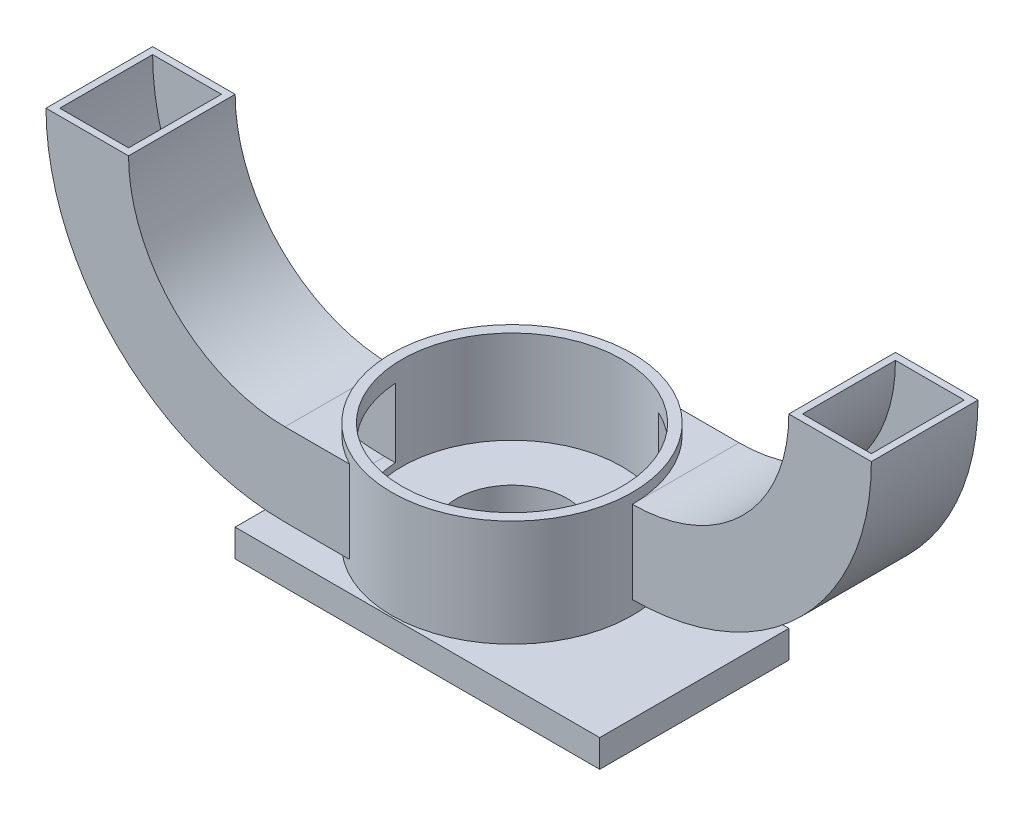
ISO-10303-21;
HEADER;
FILE_DESCRIPTION(('STEP AP214'),'2;1');
FILE_NAME('part.step','',(''),(''),'','','');
FILE_SCHEMA(('AUTOMOTIVE_DESIGN { 1 0 10303 214 1 1 1 1 }'));
ENDSEC;
DATA;
#1=APPLICATION_CONTEXT('core data for automotive mechanical design processes');
#2=APPLICATION_PROTOCOL_DEFINITION('international standard','automotive_design',2000,#1);
#3=PRODUCT_CONTEXT('',#1,'mechanical');
#4=PRODUCT('Part','Part','',(#3));
#5=PRODUCT_RELATED_PRODUCT_CATEGORY('part','',(#4));
#6=PRODUCT_DEFINITION_FORMATION('','',#4);
#7=PRODUCT_DEFINITION_CONTEXT('part definition',#1,'design');
#8=PRODUCT_DEFINITION('design','',#6,#7);
#9=PRODUCT_DEFINITION_SHAPE('','',#8);
#10=(LENGTH_UNIT() NAMED_UNIT(*) SI_UNIT(.MILLI.,.METRE.));
#11=(NAMED_UNIT(*) PLANE_ANGLE_UNIT() SI_UNIT($,.RADIAN.));
#12=(NAMED_UNIT(*) SI_UNIT($,.STERADIAN.) SOLID_ANGLE_UNIT());
#13=UNCERTAINTY_MEASURE_WITH_UNIT(LENGTH_MEASURE(1.E-05),#10,'distance_accuracy_value','');
#14=(GEOMETRIC_REPRESENTATION_CONTEXT(3) GLOBAL_UNCERTAINTY_ASSIGNED_CONTEXT((#13)) GLOBAL_UNIT_ASSIGNED_CONTEXT((#10,
#11,#12)) REPRESENTATION_CONTEXT('',''));
#15=CARTESIAN_POINT('',(0.,0.,0.));
#16=DIRECTION('',(0.,0.,1.));
#17=DIRECTION('',(1.,0.,0.));
#18=AXIS2_PLACEMENT_3D('',#15,#16,#17);
#19=CARTESIAN_POINT('',(52.2444301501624,11.,1.));
#20=DIRECTION('',(0.,-1.,0.));
#21=DIRECTION('',(0.,0.,-1.));
#22=AXIS2_PLACEMENT_3D('',#19,#20,#21);
#23=PLANE('',#22);
#24=CARTESIAN_POINT('',(0.,11.,0.));
#25=DIRECTION('',(0.,-1.,0.));
#26=DIRECTION('',(0.,0.,-1.));
#27=AXIS2_PLACEMENT_3D('',#24,#25,#26);
#28=CIRCLE('',#27,16.);
#29=CARTESIAN_POINT('',(-6.76387462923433,11.,14.5));
#30=VERTEX_POINT('',#29);
#31=CARTESIAN_POINT('',(-15.9687194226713,11.,1.));
#32=VERTEX_POINT('',#31);
#33=EDGE_CURVE('E308',#30,#32,#28,.T.);
#34=ORIENTED_EDGE('',*,*,#33,.T.);
#35=DIRECTION('',(-1.,0.,0.));
#36=VECTOR('',#35,1.);
#37=CARTESIAN_POINT('',(52.2444301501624,11.,1.));
#38=LINE('',#37,#36);
#39=CARTESIAN_POINT('',(-17.5,11.,0.999999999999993));
#40=VERTEX_POINT('',#39);
#41=EDGE_CURVE('E318',#32,#40,#38,.T.);
#42=ORIENTED_EDGE('',*,*,#41,.T.);
#43=DIRECTION('',(0.,0.,1.));
#44=VECTOR('',#43,1.);
#45=CARTESIAN_POINT('',(-17.5,11.,1.));
#46=LINE('',#45,#44);
#47=CARTESIAN_POINT('',(-17.5,11.,14.5));
#48=VERTEX_POINT('',#47);
#49=EDGE_CURVE('E350',#40,#48,#46,.T.);
#50=ORIENTED_EDGE('',*,*,#49,.T.);
#51=DIRECTION('',(-1.,0.,0.));
#52=VECTOR('',#51,1.);
#53=CARTESIAN_POINT('',(52.2444301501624,11.,14.5));
#54=LINE('',#53,#52);
#55=EDGE_CURVE('E320',#30,#48,#54,.T.);
#56=ORIENTED_EDGE('',*,*,#55,.F.);
#57=EDGE_LOOP('',(#34,#42,#50,#56));
#58=FACE_BOUND('',#57,.T.);
#59=ADVANCED_FACE('F119',(#58),#23,.F.);
#60=CARTESIAN_POINT('',(52.2444301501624,11.,14.5));
#61=DIRECTION('',(0.,0.,1.));
#62=DIRECTION('',(1.,0.,0.));
#63=AXIS2_PLACEMENT_3D('',#60,#61,#62);
#64=PLANE('',#63);
#65=DIRECTION('',(0.,-1.,0.));
#66=VECTOR('',#65,1.);
#67=CARTESIAN_POINT('',(-6.76387462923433,44.7443438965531,14.5));
#68=LINE('',#67,#66);
#69=CARTESIAN_POINT('',(-6.76387462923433,21.,14.5));
#70=VERTEX_POINT('',#69);
#71=EDGE_CURVE('E323',#70,#30,#68,.T.);
#72=ORIENTED_EDGE('',*,*,#71,.T.);
#73=ORIENTED_EDGE('',*,*,#55,.T.);
#74=CARTESIAN_POINT('',(-17.5,44.7424301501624,14.5));
#75=DIRECTION('',(0.,0.,-1.));
#76=DIRECTION('',(0.,-1.,0.));
#77=AXIS2_PLACEMENT_3D('',#74,#75,#76);
#78=CIRCLE('',#77,33.7424301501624);
#79=CARTESIAN_POINT('',(-51.2424301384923,44.7433175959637,14.5));
#80=VERTEX_POINT('',#79);
#81=EDGE_CURVE('E967',#48,#80,#78,.T.);
#82=ORIENTED_EDGE('',*,*,#81,.T.);
#83=DIRECTION('',(0.99999999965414,-2.63005894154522E-05,0.));
#84=VECTOR('',#83,1.);
#85=CARTESIAN_POINT('',(-51.2424301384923,44.7433175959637,14.5));
#86=LINE('',#85,#84);
#87=CARTESIAN_POINT('',(-41.2424301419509,44.7430545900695,14.5));
#88=VERTEX_POINT('',#87);
#89=EDGE_CURVE('E961',#88,#80,#86,.F.);
#90=ORIENTED_EDGE('',*,*,#89,.F.);
#91=CARTESIAN_POINT('',(-17.5,44.7424301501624,14.5));
#92=DIRECTION('',(0.,0.,-1.));
#93=DIRECTION('',(0.,-1.,0.));
#94=AXIS2_PLACEMENT_3D('',#91,#92,#93);
#95=CIRCLE('',#94,23.7424301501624);
#96=CARTESIAN_POINT('',(-17.5,21.,14.5));
#97=VERTEX_POINT('',#96);
#98=EDGE_CURVE('E956',#97,#88,#95,.T.);
#99=ORIENTED_EDGE('',*,*,#98,.F.);
#100=DIRECTION('',(-1.,0.,0.));
#101=VECTOR('',#100,1.);
#102=CARTESIAN_POINT('',(52.2444301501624,21.,14.5));
#103=LINE('',#102,#101);
#104=EDGE_CURVE('E335',#70,#97,#103,.T.);
#105=ORIENTED_EDGE('',*,*,#104,.F.);
#106=EDGE_LOOP('',(#72,#73,#82,#90,#99,#105));
#107=FACE_BOUND('',#106,.T.);
#108=ADVANCED_FACE('F803',(#107),#64,.F.);
#109=CARTESIAN_POINT('',(52.2444301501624,21.,1.));
#110=DIRECTION('',(0.,1.,0.));
#111=DIRECTION('',(0.,0.,1.));
#112=AXIS2_PLACEMENT_3D('',#109,#110,#111);
#113=PLANE('',#112);
#114=CARTESIAN_POINT('',(0.,21.,0.));
#115=DIRECTION('',(0.,1.,0.));
#116=DIRECTION('',(0.,0.,1.));
#117=AXIS2_PLACEMENT_3D('',#114,#115,#116);
#118=CIRCLE('',#117,16.);
#119=CARTESIAN_POINT('',(-15.9687194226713,21.,1.));
#120=VERTEX_POINT('',#119);
#121=EDGE_CURVE('E138',#120,#70,#118,.T.);
#122=ORIENTED_EDGE('',*,*,#121,.T.);
#123=ORIENTED_EDGE('',*,*,#104,.T.);
#124=DIRECTION('',(0.,0.,-1.));
#125=VECTOR('',#124,1.);
#126=CARTESIAN_POINT('',(-17.5,21.,1.));
#127=LINE('',#126,#125);
#128=CARTESIAN_POINT('',(-17.5,21.,0.999999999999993));
#129=VERTEX_POINT('',#128);
#130=EDGE_CURVE('E921',#97,#129,#127,.T.);
#131=ORIENTED_EDGE('',*,*,#130,.T.);
#132=DIRECTION('',(-1.,0.,0.));
#133=VECTOR('',#132,1.);
#134=CARTESIAN_POINT('',(52.2444301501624,21.,1.));
#135=LINE('',#134,#133);
#136=EDGE_CURVE('E343',#120,#129,#135,.T.);
#137=ORIENTED_EDGE('',*,*,#136,.F.);
#138=EDGE_LOOP('',(#122,#123,#131,#137));
#139=FACE_BOUND('',#138,.T.);
#140=ADVANCED_FACE('F808',(#139),#113,.F.);
#141=CARTESIAN_POINT('',(52.2444301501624,11.,1.));
#142=DIRECTION('',(0.,0.,-1.));
#143=DIRECTION('',(-1.,0.,0.));
#144=AXIS2_PLACEMENT_3D('',#141,#142,#143);
#145=PLANE('',#144);
#146=DIRECTION('',(0.,-1.,0.));
#147=VECTOR('',#146,1.);
#148=CARTESIAN_POINT('',(-15.9687194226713,44.7443438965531,1.));
#149=LINE('',#148,#147);
#150=EDGE_CURVE('E305',#32,#120,#149,.F.);
#151=ORIENTED_EDGE('',*,*,#150,.T.);
#152=ORIENTED_EDGE('',*,*,#136,.T.);
#153=CARTESIAN_POINT('',(-17.5,44.7424301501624,0.999999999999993));
#154=DIRECTION('',(0.,0.,-1.));
#155=DIRECTION('',(0.,-1.,0.));
#156=AXIS2_PLACEMENT_3D('',#153,#154,#155);
#157=CIRCLE('',#156,23.7424301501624);
#158=CARTESIAN_POINT('',(-41.2424301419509,44.7430545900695,0.999999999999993));
#159=VERTEX_POINT('',#158);
#160=EDGE_CURVE('E958',#129,#159,#157,.T.);
#161=ORIENTED_EDGE('',*,*,#160,.T.);
#162=DIRECTION('',(-0.99999999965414,2.63005894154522E-05,0.));
#163=VECTOR('',#162,1.);
#164=CARTESIAN_POINT('',(-51.2424301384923,44.7433175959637,0.999999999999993));
#165=LINE('',#164,#163);
#166=CARTESIAN_POINT('',(-51.2424301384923,44.7433175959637,0.999999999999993));
#167=VERTEX_POINT('',#166);
#168=EDGE_CURVE('E980',#167,#159,#165,.F.);
#169=ORIENTED_EDGE('',*,*,#168,.F.);
#170=CARTESIAN_POINT('',(-17.5,44.7424301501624,0.999999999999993));
#171=DIRECTION('',(0.,0.,-1.));
#172=DIRECTION('',(0.,-1.,0.));
#173=AXIS2_PLACEMENT_3D('',#170,#171,#172);
#174=CIRCLE('',#173,33.7424301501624);
#175=EDGE_CURVE('E329',#40,#167,#174,.T.);
#176=ORIENTED_EDGE('',*,*,#175,.F.);
#177=ORIENTED_EDGE('',*,*,#41,.F.);
#178=EDGE_LOOP('',(#151,#152,#161,#169,#176,#177));
#179=FACE_BOUND('',#178,.T.);
#180=ADVANCED_FACE('F326',(#179),#145,.F.);
#181=CARTESIAN_POINT('',(26.5,4.,-13.75));
#182=DIRECTION('',(-1.,0.,0.));
#183=DIRECTION('',(0.,0.,1.));
#184=AXIS2_PLACEMENT_3D('',#181,#182,#183);
#185=PLANE('',#184);
#186=CARTESIAN_POINT('',(26.5,0.,-13.75));
#187=CARTESIAN_POINT('',(26.5,0.,-11.4583333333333));
#188=CARTESIAN_POINT('',(26.5,0.,-9.16666666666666));
#189=CARTESIAN_POINT('',(26.5,0.,-4.58333333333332));
#190=CARTESIAN_POINT('',(26.5,0.,-2.29166666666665));
#191=CARTESIAN_POINT('',(26.5,0.,2.29166666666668));
#192=CARTESIAN_POINT('',(26.5,0.,4.58333333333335));
#193=CARTESIAN_POINT('',(26.5,0.,9.16666666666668));
#194=CARTESIAN_POINT('',(26.5,0.,11.4583333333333));
#195=CARTESIAN_POINT('',(26.5,0.,13.75));
#196=B_SPLINE_CURVE_WITH_KNOTS('',3,(#186,#187,#188,#189,#190,#191,#192,#193,#194,#195),
.UNSPECIFIED.,.F.,.F.,(4,2,2,2,4),(0.,0.25,0.5,0.75,1.),.UNSPECIFIED.);
#197=CARTESIAN_POINT('',(26.5,0.,13.75));
#198=VERTEX_POINT('',#197);
#199=CARTESIAN_POINT('',(26.5,0.,-13.75));
#200=VERTEX_POINT('',#199);
#201=EDGE_CURVE('E608',#198,#200,#196,.F.);
#202=ORIENTED_EDGE('',*,*,#201,.T.);
#203=DIRECTION('',(0.,-1.,0.));
#204=VECTOR('',#203,1.);
#205=CARTESIAN_POINT('',(26.5,4.,-13.75));
#206=LINE('',#205,#204);
#207=CARTESIAN_POINT('',(26.5,4.,-13.75));
#208=VERTEX_POINT('',#207);
#209=EDGE_CURVE('E131',#208,#200,#206,.T.);
#210=ORIENTED_EDGE('',*,*,#209,.F.);
#211=DIRECTION('',(0.,0.,-1.));
#212=VECTOR('',#211,1.);
#213=CARTESIAN_POINT('',(26.5,4.,-13.75));
#214=LINE('',#213,#212);
#215=CARTESIAN_POINT('',(26.5,4.,13.75));
#216=VERTEX_POINT('',#215);
#217=EDGE_CURVE('E741',#216,#208,#214,.T.);
#218=ORIENTED_EDGE('',*,*,#217,.F.);
#219=DIRECTION('',(0.,-1.,0.));
#220=VECTOR('',#219,1.);
#221=CARTESIAN_POINT('',(26.5,4.,13.75));
#222=LINE('',#221,#220);
#223=EDGE_CURVE('E671',#216,#198,#222,.T.);
#224=ORIENTED_EDGE('',*,*,#223,.T.);
#225=EDGE_LOOP('',(#202,#210,#218,#224));
#226=FACE_BOUND('',#225,.T.);
#227=ADVANCED_FACE('F121',(#226),#185,.F.);
#228=CARTESIAN_POINT('',(-26.5,4.,-13.75));
#229=DIRECTION('',(0.,0.,1.));
#230=DIRECTION('',(1.,0.,0.));
#231=AXIS2_PLACEMENT_3D('',#228,#229,#230);
#232=PLANE('',#231);
#233=CARTESIAN_POINT('',(-26.5,0.,-13.75));
#234=CARTESIAN_POINT('',(-24.2916666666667,0.,-13.75));
#235=CARTESIAN_POINT('',(-22.0833333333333,0.,-13.75));
#236=CARTESIAN_POINT('',(-17.6666666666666,0.,-13.75));
#237=CARTESIAN_POINT('',(-15.4583333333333,0.,-13.75));
#238=CARTESIAN_POINT('',(-11.0416666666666,0.,-13.75));
#239=CARTESIAN_POINT('',(-8.8333333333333,0.,-13.75));
#240=CARTESIAN_POINT('',(-4.41666666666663,0.,-13.75));
#241=CARTESIAN_POINT('',(-2.2083333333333,0.,-13.75));
#242=CARTESIAN_POINT('',(2.20833333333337,0.,-13.75));
#243=CARTESIAN_POINT('',(4.4166666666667,0.,-13.75));
#244=CARTESIAN_POINT('',(8.83333333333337,0.,-13.75));
#245=CARTESIAN_POINT('',(11.0416666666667,0.,-13.75));
#246=CARTESIAN_POINT('',(15.4583333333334,0.,-13.75));
#247=CARTESIAN_POINT('',(17.6666666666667,0.,-13.75));
#248=CARTESIAN_POINT('',(22.0833333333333,0.,-13.75));
#249=CARTESIAN_POINT('',(24.2916666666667,0.,-13.75));
#250=CARTESIAN_POINT('',(26.5,0.,-13.75));
#251=B_SPLINE_CURVE_WITH_KNOTS('',3,(#233,#234,#235,#236,#237,#238,#239,#240,#241,#242,#243,
#244,#245,#246,#247,#248,#249,#250),.UNSPECIFIED.,.F.,.F.,(4,2,2,2,2,2,2,2,4),(0.,0.125,0.25,
0.375,0.5,0.625,0.75,0.875,1.),.UNSPECIFIED.);
#252=CARTESIAN_POINT('',(-26.5,0.,-13.75));
#253=VERTEX_POINT('',#252);
#254=EDGE_CURVE('E518',#200,#253,#251,.F.);
#255=ORIENTED_EDGE('',*,*,#254,.T.);
#256=DIRECTION('',(0.,-1.,0.));
#257=VECTOR('',#256,1.);
#258=CARTESIAN_POINT('',(-26.5,4.,-13.75));
#259=LINE('',#258,#257);
#260=CARTESIAN_POINT('',(-26.5,4.,-13.75));
#261=VERTEX_POINT('',#260);
#262=EDGE_CURVE('E666',#261,#253,#259,.T.);
#263=ORIENTED_EDGE('',*,*,#262,.F.);
#264=DIRECTION('',(-1.,0.,0.));
#265=VECTOR('',#264,1.);
#266=CARTESIAN_POINT('',(-26.5,4.,-13.75));
#267=LINE('',#266,#265);
#268=EDGE_CURVE('E661',#208,#261,#267,.T.);
#269=ORIENTED_EDGE('',*,*,#268,.F.);
#270=ORIENTED_EDGE('',*,*,#209,.T.);
#271=EDGE_LOOP('',(#255,#263,#269,#270));
#272=FACE_BOUND('',#271,.T.);
#273=ADVANCED_FACE('F657',(#272),#232,.F.);
#274=CARTESIAN_POINT('',(-26.5,4.,-13.75));
#275=DIRECTION('',(1.,0.,0.));
#276=DIRECTION('',(0.,0.,-1.));
#277=AXIS2_PLACEMENT_3D('',#274,#275,#276);
#278=PLANE('',#277);
#279=CARTESIAN_POINT('',(-26.5,0.,13.75));
#280=CARTESIAN_POINT('',(-26.5,0.,11.4583333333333));
#281=CARTESIAN_POINT('',(-26.5,0.,9.16666666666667));
#282=CARTESIAN_POINT('',(-26.5,0.,4.58333333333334));
#283=CARTESIAN_POINT('',(-26.5,0.,2.29166666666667));
#284=CARTESIAN_POINT('',(-26.5,0.,-2.29166666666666));
#285=CARTESIAN_POINT('',(-26.5,0.,-4.58333333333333));
#286=CARTESIAN_POINT('',(-26.5,0.,-9.16666666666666));
#287=CARTESIAN_POINT('',(-26.5,0.,-11.4583333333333));
#288=CARTESIAN_POINT('',(-26.5,0.,-13.75));
#289=B_SPLINE_CURVE_WITH_KNOTS('',3,(#279,#280,#281,#282,#283,#284,#285,#286,#287,#288),
.UNSPECIFIED.,.F.,.F.,(4,2,2,2,4),(0.,0.25,0.5,0.75,1.),.UNSPECIFIED.);
#290=CARTESIAN_POINT('',(-26.5,0.,13.75));
#291=VERTEX_POINT('',#290);
#292=EDGE_CURVE('E643',#253,#291,#289,.F.);
#293=ORIENTED_EDGE('',*,*,#292,.T.);
#294=DIRECTION('',(0.,-1.,0.));
#295=VECTOR('',#294,1.);
#296=CARTESIAN_POINT('',(-26.5,4.,13.75));
#297=LINE('',#296,#295);
#298=CARTESIAN_POINT('',(-26.5,4.,13.75));
#299=VERTEX_POINT('',#298);
#300=EDGE_CURVE('E687',#299,#291,#297,.T.);
#301=ORIENTED_EDGE('',*,*,#300,.F.);
#302=DIRECTION('',(0.,0.,1.));
#303=VECTOR('',#302,1.);
#304=CARTESIAN_POINT('',(-26.5,4.,-13.75));
#305=LINE('',#304,#303);
#306=EDGE_CURVE('E746',#261,#299,#305,.T.);
#307=ORIENTED_EDGE('',*,*,#306,.F.);
#308=ORIENTED_EDGE('',*,*,#262,.T.);
#309=EDGE_LOOP('',(#293,#301,#307,#308));
#310=FACE_BOUND('',#309,.T.);
#311=ADVANCED_FACE('F710',(#310),#278,.F.);
#312=CARTESIAN_POINT('',(-26.5,4.,13.75));
#313=DIRECTION('',(0.,0.,-1.));
#314=DIRECTION('',(-1.,0.,0.));
#315=AXIS2_PLACEMENT_3D('',#312,#313,#314);
#316=PLANE('',#315);
#317=CARTESIAN_POINT('',(26.5,0.,13.75));
#318=CARTESIAN_POINT('',(24.2916666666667,0.,13.75));
#319=CARTESIAN_POINT('',(22.0833333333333,0.,13.75));
#320=CARTESIAN_POINT('',(17.6666666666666,0.,13.75));
#321=CARTESIAN_POINT('',(15.4583333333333,0.,13.75));
#322=CARTESIAN_POINT('',(11.0416666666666,0.,13.75));
#323=CARTESIAN_POINT('',(8.83333333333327,0.,13.75));
#324=CARTESIAN_POINT('',(4.4166666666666,0.,13.75));
#325=CARTESIAN_POINT('',(2.20833333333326,0.,13.75));
#326=CARTESIAN_POINT('',(-2.2083333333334,0.,13.75));
#327=CARTESIAN_POINT('',(-4.41666666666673,0.,13.75));
#328=CARTESIAN_POINT('',(-8.83333333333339,0.,13.75));
#329=CARTESIAN_POINT('',(-11.0416666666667,0.,13.75));
#330=CARTESIAN_POINT('',(-15.4583333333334,0.,13.75));
#331=CARTESIAN_POINT('',(-17.6666666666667,0.,13.75));
#332=CARTESIAN_POINT('',(-22.0833333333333,0.,13.75));
#333=CARTESIAN_POINT('',(-24.2916666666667,0.,13.75));
#334=CARTESIAN_POINT('',(-26.5,0.,13.75));
#335=B_SPLINE_CURVE_WITH_KNOTS('',3,(#317,#318,#319,#320,#321,#322,#323,#324,#325,#326,#327,
#328,#329,#330,#331,#332,#333,#334),.UNSPECIFIED.,.F.,.F.,(4,2,2,2,2,2,2,2,4),(0.,0.125,0.25,
0.375,0.5,0.625,0.75,0.875,1.),.UNSPECIFIED.);
#336=EDGE_CURVE('E626',#291,#198,#335,.F.);
#337=ORIENTED_EDGE('',*,*,#336,.T.);
#338=ORIENTED_EDGE('',*,*,#223,.F.);
#339=DIRECTION('',(1.,0.,0.));
#340=VECTOR('',#339,1.);
#341=CARTESIAN_POINT('',(-26.5,4.,13.75));
#342=LINE('',#341,#340);
#343=EDGE_CURVE('E688',#299,#216,#342,.T.);
#344=ORIENTED_EDGE('',*,*,#343,.F.);
#345=ORIENTED_EDGE('',*,*,#300,.T.);
#346=EDGE_LOOP('',(#337,#338,#344,#345));
#347=FACE_BOUND('',#346,.T.);
#348=ADVANCED_FACE('F699',(#347),#316,.F.);
#349=CARTESIAN_POINT('',(0.,4.,0.));
#350=DIRECTION('',(0.,1.,0.));
#351=DIRECTION('',(0.,0.,1.));
#352=AXIS2_PLACEMENT_3D('',#349,#350,#351);
#353=PLANE('',#352);
#354=CARTESIAN_POINT('',(0.,4.,0.));
#355=DIRECTION('',(0.,1.,0.));
#356=DIRECTION('',(0.,0.,1.));
#357=AXIS2_PLACEMENT_3D('',#354,#355,#356);
#358=CIRCLE('',#357,9.5);
#359=CARTESIAN_POINT('',(0.,4.,9.5));
#360=VERTEX_POINT('',#359);
#361=EDGE_CURVE('E737',#360,#360,#358,.T.);
#362=ORIENTED_EDGE('',*,*,#361,.F.);
#363=EDGE_LOOP('',(#362));
#364=FACE_BOUND('',#363,.T.);
#365=ORIENTED_EDGE('',*,*,#217,.T.);
#366=ORIENTED_EDGE('',*,*,#268,.T.);
#367=ORIENTED_EDGE('',*,*,#306,.T.);
#368=ORIENTED_EDGE('',*,*,#343,.T.);
#369=EDGE_LOOP('',(#365,#366,#367,#368));
#370=FACE_BOUND('',#369,.T.);
#371=ADVANCED_FACE('F709',(#364,#370),#353,.T.);
#372=CARTESIAN_POINT('',(0.,8.,0.));
#373=DIRECTION('',(0.,-1.,0.));
#374=DIRECTION('',(0.,0.,-1.));
#375=AXIS2_PLACEMENT_3D('',#372,#373,#374);
#376=CYLINDRICAL_SURFACE('',#375,9.5);
#377=CARTESIAN_POINT('',(0.,8.,0.));
#378=DIRECTION('',(0.,1.,0.));
#379=DIRECTION('',(0.,0.,1.));
#380=AXIS2_PLACEMENT_3D('',#377,#378,#379);
#381=CIRCLE('',#380,9.5);
#382=CARTESIAN_POINT('',(0.,8.,9.5));
#383=VERTEX_POINT('',#382);
#384=EDGE_CURVE('E673',#383,#383,#381,.T.);
#385=ORIENTED_EDGE('',*,*,#384,.F.);
#386=EDGE_LOOP('',(#385));
#387=FACE_BOUND('',#386,.T.);
#388=ORIENTED_EDGE('',*,*,#361,.T.);
#389=EDGE_LOOP('',(#388));
#390=FACE_BOUND('',#389,.T.);
#391=ADVANCED_FACE('F788',(#387,#390),#376,.T.);
#392=CARTESIAN_POINT('',(0.,8.,0.));
#393=DIRECTION('',(0.,-1.,0.));
#394=DIRECTION('',(0.,0.,-1.));
#395=AXIS2_PLACEMENT_3D('',#392,#393,#394);
#396=CYLINDRICAL_SURFACE('',#395,8.);
#397=CARTESIAN_POINT('',(-7.10102206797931,4.,-3.6844925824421));
#398=CARTESIAN_POINT('',(-7.38384468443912,4.,-3.13941626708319));
#399=CARTESIAN_POINT('',(-7.61124088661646,4.,-2.54558802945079));
#400=CARTESIAN_POINT('',(-7.91949557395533,4.,-1.30099811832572));
#401=CARTESIAN_POINT('',(-8.,4.,-0.650638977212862));
#402=CARTESIAN_POINT('',(-8.,4.,0.650638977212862));
#403=CARTESIAN_POINT('',(-7.91949557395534,4.,1.30099811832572));
#404=CARTESIAN_POINT('',(-7.61124088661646,4.,2.54558802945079));
#405=CARTESIAN_POINT('',(-7.38384468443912,4.,3.13941626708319));
#406=CARTESIAN_POINT('',(-7.10102206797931,4.,3.6844925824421));
#407=B_SPLINE_CURVE_WITH_KNOTS('',3,(#397,#398,#399,#400,#401,#402,#403,#404,#405,#406),
.UNSPECIFIED.,.F.,.F.,(4,2,2,2,4),(0.,0.25,0.5,0.75,1.),.UNSPECIFIED.);
#408=CARTESIAN_POINT('',(-7.10134528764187,4.,3.68465908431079));
#409=VERTEX_POINT('',#408);
#410=CARTESIAN_POINT('',(-7.10131944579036,4.,-3.68464576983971));
#411=VERTEX_POINT('',#410);
#412=EDGE_CURVE('E12',#409,#411,#407,.F.);
#413=ORIENTED_EDGE('',*,*,#412,.T.);
#414=CARTESIAN_POINT('',(0.,4.,0.));
#415=DIRECTION('',(0.,-1.,0.));
#416=DIRECTION('',(0.,0.,1.));
#417=AXIS2_PLACEMENT_3D('',#414,#415,#416);
#418=CIRCLE('',#417,8.);
#419=CARTESIAN_POINT('',(7.10134528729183,4.,-3.68465908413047));
#420=VERTEX_POINT('',#419);
#421=EDGE_CURVE('E653',#411,#420,#418,.T.);
#422=ORIENTED_EDGE('',*,*,#421,.T.);
#423=CARTESIAN_POINT('',(7.10131944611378,4.,3.68464577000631));
#424=VERTEX_POINT('',#423);
#425=EDGE_CURVE('E569',#420,#424,#418,.T.);
#426=ORIENTED_EDGE('',*,*,#425,.T.);
#427=EDGE_CURVE('E124',#424,#409,#418,.T.);
#428=ORIENTED_EDGE('',*,*,#427,.T.);
#429=EDGE_LOOP('',(#413,#422,#426,#428));
#430=FACE_BOUND('',#429,.T.);
#431=CARTESIAN_POINT('',(0.,10.,0.));
#432=DIRECTION('',(0.,1.,0.));
#433=DIRECTION('',(0.,0.,1.));
#434=AXIS2_PLACEMENT_3D('',#431,#432,#433);
#435=CIRCLE('',#434,8.);
#436=CARTESIAN_POINT('',(0.,10.,8.));
#437=VERTEX_POINT('',#436);
#438=EDGE_CURVE('E509',#437,#437,#435,.T.);
#439=ORIENTED_EDGE('',*,*,#438,.T.);
#440=EDGE_LOOP('',(#439));
#441=FACE_BOUND('',#440,.T.);
#442=ADVANCED_FACE('F544',(#430,#441),#396,.F.);
#443=CARTESIAN_POINT('',(-26.5,0.,13.75));
#444=CARTESIAN_POINT('',(-7.10102206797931,4.,3.6844925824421));
#445=CARTESIAN_POINT('',(-24.2916666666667,0.,13.75));
#446=CARTESIAN_POINT('',(-6.82848391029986,4.,4.20974794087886));
#447=CARTESIAN_POINT('',(-22.0833333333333,0.,13.75));
#448=CARTESIAN_POINT('',(-6.47840329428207,4.,4.74135288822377));
#449=CARTESIAN_POINT('',(-17.6666666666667,0.,13.75));
#450=CARTESIAN_POINT('',(-5.59819436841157,4.,5.75415990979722));
#451=CARTESIAN_POINT('',(-15.4583333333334,0.,13.75));
#452=CARTESIAN_POINT('',(-5.06727923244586,4.,6.23481894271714));
#453=CARTESIAN_POINT('',(-11.0416666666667,0.,13.75));
#454=CARTESIAN_POINT('',(-3.83447305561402,4.,7.06024804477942));
#455=CARTESIAN_POINT('',(-8.83333333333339,0.,13.75));
#456=CARTESIAN_POINT('',(-3.13235785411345,4.,7.40375831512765));
#457=CARTESIAN_POINT('',(-4.41666666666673,0.,13.75));
#458=CARTESIAN_POINT('',(-1.61978954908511,4.,7.87423550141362));
#459=CARTESIAN_POINT('',(-2.2083333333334,0.,13.75));
#460=CARTESIAN_POINT('',(-0.810307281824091,4.,8.));
#461=CARTESIAN_POINT('',(2.20833333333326,0.,13.75));
#462=CARTESIAN_POINT('',(0.810307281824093,4.,8.));
#463=CARTESIAN_POINT('',(4.4166666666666,0.,13.75));
#464=CARTESIAN_POINT('',(1.61978954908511,4.,7.87423550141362));
#465=CARTESIAN_POINT('',(8.83333333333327,0.,13.75));
#466=CARTESIAN_POINT('',(3.13235785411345,4.,7.40375831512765));
#467=CARTESIAN_POINT('',(11.0416666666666,0.,13.75));
#468=CARTESIAN_POINT('',(3.83447305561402,4.,7.06024804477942));
#469=CARTESIAN_POINT('',(15.4583333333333,0.,13.75));
#470=CARTESIAN_POINT('',(5.06727923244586,4.,6.23481894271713));
#471=CARTESIAN_POINT('',(17.6666666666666,0.,13.75));
#472=CARTESIAN_POINT('',(5.59819436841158,4.,5.75415990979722));
#473=CARTESIAN_POINT('',(22.0833333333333,0.,13.75));
#474=CARTESIAN_POINT('',(6.47840329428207,4.,4.74135288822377));
#475=CARTESIAN_POINT('',(24.2916666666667,0.,13.75));
#476=CARTESIAN_POINT('',(6.82848391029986,4.,4.20974794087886));
#477=CARTESIAN_POINT('',(26.5,0.,13.75));
#478=CARTESIAN_POINT('',(7.10102206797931,4.,3.68449258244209));
#479=B_SPLINE_SURFACE_WITH_KNOTS('',3,1,((#443,#444),(#445,#446),(#447,#448),(#449,#450),(#451,
#452),(#453,#454),(#455,#456),(#457,#458),(#459,#460),(#461,#462),(#463,#464),(#465,#466),(#467,
#468),(#469,#470),(#471,#472),(#473,#474),(#475,#476),(#477,#478)),.UNSPECIFIED.,.F.,.F.,.F.,(4,
2,2,2,2,2,2,2,4),(2,2),(0.,0.125,0.25,0.375,0.5,0.625,0.75,0.875,1.),(0.,1.),.UNSPECIFIED.);
#480=DIRECTION('',(-0.87312409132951,-0.180035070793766,0.453036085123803));
#481=VECTOR('',#480,1.);
#482=CARTESIAN_POINT('',(-16.8005110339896,2.,8.71724629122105));
#483=LINE('',#482,#481);
#484=EDGE_CURVE('E513',#409,#291,#483,.T.);
#485=DIRECTION('',(-0.87312409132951,0.180035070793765,-0.453036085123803));
#486=VECTOR('',#485,1.);
#487=CARTESIAN_POINT('',(16.8005110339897,2.,8.71724629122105));
#488=LINE('',#487,#486);
#489=EDGE_CURVE('E612',#198,#424,#488,.T.);
#490=ORIENTED_EDGE('',*,*,#336,.F.);
#491=ORIENTED_EDGE('',*,*,#484,.F.);
#492=ORIENTED_EDGE('',*,*,#427,.F.);
#493=ORIENTED_EDGE('',*,*,#489,.F.);
#494=EDGE_LOOP('',(#490,#491,#492,#493));
#495=FACE_BOUND('',#494,.T.);
#496=ADVANCED_FACE('F586',(#495),#479,.F.);
#497=CARTESIAN_POINT('',(26.5,0.,13.75));
#498=CARTESIAN_POINT('',(7.10102206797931,4.,3.68449258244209));
#499=CARTESIAN_POINT('',(26.5,0.,11.4583333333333));
#500=CARTESIAN_POINT('',(7.38384468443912,4.,3.13941626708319));
#501=CARTESIAN_POINT('',(26.5,0.,9.16666666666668));
#502=CARTESIAN_POINT('',(7.61124088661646,4.,2.54558802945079));
#503=CARTESIAN_POINT('',(26.5,0.,4.58333333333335));
#504=CARTESIAN_POINT('',(7.91949557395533,4.,1.30099811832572));
#505=CARTESIAN_POINT('',(26.5,0.,2.29166666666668));
#506=CARTESIAN_POINT('',(8.,4.,0.650638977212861));
#507=CARTESIAN_POINT('',(26.5,0.,-2.29166666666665));
#508=CARTESIAN_POINT('',(8.,4.,-0.650638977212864));
#509=CARTESIAN_POINT('',(26.5,0.,-4.58333333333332));
#510=CARTESIAN_POINT('',(7.91949557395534,4.,-1.30099811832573));
#511=CARTESIAN_POINT('',(26.5,0.,-9.16666666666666));
#512=CARTESIAN_POINT('',(7.61124088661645,4.,-2.54558802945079));
#513=CARTESIAN_POINT('',(26.5,0.,-11.4583333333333));
#514=CARTESIAN_POINT('',(7.38384468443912,4.,-3.13941626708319));
#515=CARTESIAN_POINT('',(26.5,0.,-13.75));
#516=CARTESIAN_POINT('',(7.10102206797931,4.,-3.6844925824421));
#517=B_SPLINE_SURFACE_WITH_KNOTS('',3,1,((#497,#498),(#499,#500),(#501,#502),(#503,#504),(#505,
#506),(#507,#508),(#509,#510),(#511,#512),(#513,#514),(#515,#516)),.UNSPECIFIED.,.F.,.F.,.F.,(4,
2,2,2,4),(2,2),(0.,0.25,0.5,0.75,1.),(0.,1.),.UNSPECIFIED.);
#518=DIRECTION('',(-0.87312409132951,0.180035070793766,0.453036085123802));
#519=VECTOR('',#518,1.);
#520=CARTESIAN_POINT('',(16.8005110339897,2.,-8.71724629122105));
#521=LINE('',#520,#519);
#522=EDGE_CURVE('E524',#200,#420,#521,.T.);
#523=ORIENTED_EDGE('',*,*,#201,.F.);
#524=ORIENTED_EDGE('',*,*,#489,.T.);
#525=ORIENTED_EDGE('',*,*,#425,.F.);
#526=ORIENTED_EDGE('',*,*,#522,.F.);
#527=EDGE_LOOP('',(#523,#524,#525,#526));
#528=FACE_BOUND('',#527,.T.);
#529=ADVANCED_FACE('F575',(#528),#517,.F.);
#530=CARTESIAN_POINT('',(-26.5,0.,-13.75));
#531=CARTESIAN_POINT('',(-7.10102206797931,4.,-3.6844925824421));
#532=CARTESIAN_POINT('',(-26.5,0.,-11.4583333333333));
#533=CARTESIAN_POINT('',(-7.38384468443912,4.,-3.13941626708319));
#534=CARTESIAN_POINT('',(-26.5,0.,-9.16666666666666));
#535=CARTESIAN_POINT('',(-7.61124088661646,4.,-2.54558802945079));
#536=CARTESIAN_POINT('',(-26.5,0.,-4.58333333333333));
#537=CARTESIAN_POINT('',(-7.91949557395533,4.,-1.30099811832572));
#538=CARTESIAN_POINT('',(-26.5,0.,-2.29166666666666));
#539=CARTESIAN_POINT('',(-8.,4.,-0.650638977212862));
#540=CARTESIAN_POINT('',(-26.5,0.,2.29166666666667));
#541=CARTESIAN_POINT('',(-8.,4.,0.650638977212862));
#542=CARTESIAN_POINT('',(-26.5,0.,4.58333333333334));
#543=CARTESIAN_POINT('',(-7.91949557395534,4.,1.30099811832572));
#544=CARTESIAN_POINT('',(-26.5,0.,9.16666666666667));
#545=CARTESIAN_POINT('',(-7.61124088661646,4.,2.54558802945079));
#546=CARTESIAN_POINT('',(-26.5,0.,11.4583333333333));
#547=CARTESIAN_POINT('',(-7.38384468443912,4.,3.13941626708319));
#548=CARTESIAN_POINT('',(-26.5,0.,13.75));
#549=CARTESIAN_POINT('',(-7.10102206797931,4.,3.6844925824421));
#550=B_SPLINE_SURFACE_WITH_KNOTS('',3,1,((#530,#531),(#532,#533),(#534,#535),(#536,#537),(#538,
#539),(#540,#541),(#542,#543),(#544,#545),(#546,#547),(#548,#549)),.UNSPECIFIED.,.F.,.F.,.F.,(4,
2,2,2,4),(2,2),(0.,0.25,0.5,0.75,1.),(0.,1.),.UNSPECIFIED.);
#551=DIRECTION('',(0.87312409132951,0.180035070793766,0.453036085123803));
#552=VECTOR('',#551,1.);
#553=CARTESIAN_POINT('',(-16.8005110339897,2.,-8.71724629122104));
#554=LINE('',#553,#552);
#555=EDGE_CURVE('E646',#253,#411,#554,.T.);
#556=ORIENTED_EDGE('',*,*,#292,.F.);
#557=ORIENTED_EDGE('',*,*,#555,.T.);
#558=ORIENTED_EDGE('',*,*,#412,.F.);
#559=ORIENTED_EDGE('',*,*,#484,.T.);
#560=EDGE_LOOP('',(#556,#557,#558,#559));
#561=FACE_BOUND('',#560,.T.);
#562=ADVANCED_FACE('F539',(#561),#550,.F.);
#563=CARTESIAN_POINT('',(26.5,0.,-13.75));
#564=CARTESIAN_POINT('',(7.10102206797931,4.,-3.6844925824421));
#565=CARTESIAN_POINT('',(24.2916666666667,0.,-13.75));
#566=CARTESIAN_POINT('',(6.82848391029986,4.,-4.20974794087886));
#567=CARTESIAN_POINT('',(22.0833333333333,0.,-13.75));
#568=CARTESIAN_POINT('',(6.47840329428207,4.,-4.74135288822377));
#569=CARTESIAN_POINT('',(17.6666666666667,0.,-13.75));
#570=CARTESIAN_POINT('',(5.59819436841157,4.,-5.75415990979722));
#571=CARTESIAN_POINT('',(15.4583333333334,0.,-13.75));
#572=CARTESIAN_POINT('',(5.06727923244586,4.,-6.23481894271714));
#573=CARTESIAN_POINT('',(11.0416666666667,0.,-13.75));
#574=CARTESIAN_POINT('',(3.83447305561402,4.,-7.06024804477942));
#575=CARTESIAN_POINT('',(8.83333333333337,0.,-13.75));
#576=CARTESIAN_POINT('',(3.13235785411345,4.,-7.40375831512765));
#577=CARTESIAN_POINT('',(4.4166666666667,0.,-13.75));
#578=CARTESIAN_POINT('',(1.61978954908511,4.,-7.87423550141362));
#579=CARTESIAN_POINT('',(2.20833333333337,0.,-13.75));
#580=CARTESIAN_POINT('',(0.810307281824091,4.,-8.));
#581=CARTESIAN_POINT('',(-2.2083333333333,0.,-13.75));
#582=CARTESIAN_POINT('',(-0.810307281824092,4.,-8.));
#583=CARTESIAN_POINT('',(-4.41666666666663,0.,-13.75));
#584=CARTESIAN_POINT('',(-1.61978954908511,4.,-7.87423550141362));
#585=CARTESIAN_POINT('',(-8.8333333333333,0.,-13.75));
#586=CARTESIAN_POINT('',(-3.13235785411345,4.,-7.40375831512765));
#587=CARTESIAN_POINT('',(-11.0416666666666,0.,-13.75));
#588=CARTESIAN_POINT('',(-3.83447305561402,4.,-7.06024804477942));
#589=CARTESIAN_POINT('',(-15.4583333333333,0.,-13.75));
#590=CARTESIAN_POINT('',(-5.06727923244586,4.,-6.23481894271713));
#591=CARTESIAN_POINT('',(-17.6666666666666,0.,-13.75));
#592=CARTESIAN_POINT('',(-5.59819436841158,4.,-5.75415990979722));
#593=CARTESIAN_POINT('',(-22.0833333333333,0.,-13.75));
#594=CARTESIAN_POINT('',(-6.47840329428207,4.,-4.74135288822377));
#595=CARTESIAN_POINT('',(-24.2916666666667,0.,-13.75));
#596=CARTESIAN_POINT('',(-6.82848391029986,4.,-4.20974794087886));
#597=CARTESIAN_POINT('',(-26.5,0.,-13.75));
#598=CARTESIAN_POINT('',(-7.10102206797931,4.,-3.68449258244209));
#599=B_SPLINE_SURFACE_WITH_KNOTS('',3,1,((#563,#564),(#565,#566),(#567,#568),(#569,#570),(#571,
#572),(#573,#574),(#575,#576),(#577,#578),(#579,#580),(#581,#582),(#583,#584),(#585,#586),(#587,
#588),(#589,#590),(#591,#592),(#593,#594),(#595,#596),(#597,#598)),.UNSPECIFIED.,.F.,.F.,.F.,(4,
2,2,2,2,2,2,2,4),(2,2),(0.,0.125,0.25,0.375,0.5,0.625,0.75,0.875,1.),(0.,1.),.UNSPECIFIED.);
#600=ORIENTED_EDGE('',*,*,#254,.F.);
#601=ORIENTED_EDGE('',*,*,#522,.T.);
#602=ORIENTED_EDGE('',*,*,#421,.F.);
#603=ORIENTED_EDGE('',*,*,#555,.F.);
#604=EDGE_LOOP('',(#600,#601,#602,#603));
#605=FACE_BOUND('',#604,.T.);
#606=ADVANCED_FACE('F526',(#605),#599,.F.);
#607=CARTESIAN_POINT('',(0.,10.,0.));
#608=DIRECTION('',(0.,1.,0.));
#609=DIRECTION('',(0.,0.,1.));
#610=AXIS2_PLACEMENT_3D('',#607,#608,#609);
#611=PLANE('',#610);
#612=CARTESIAN_POINT('',(0.,10.,0.));
#613=DIRECTION('',(0.,1.,0.));
#614=DIRECTION('',(0.,0.,1.));
#615=AXIS2_PLACEMENT_3D('',#612,#613,#614);
#616=CIRCLE('',#615,16.);
#617=CARTESIAN_POINT('',(0.,10.,16.));
#618=VERTEX_POINT('',#617);
#619=EDGE_CURVE('E502',#618,#618,#616,.F.);
#620=ORIENTED_EDGE('',*,*,#619,.F.);
#621=EDGE_LOOP('',(#620));
#622=FACE_BOUND('',#621,.T.);
#623=ORIENTED_EDGE('',*,*,#438,.F.);
#624=EDGE_LOOP('',(#623));
#625=FACE_BOUND('',#624,.T.);
#626=ADVANCED_FACE('F538',(#622,#625),#611,.T.);
#627=CARTESIAN_POINT('',(0.,8.,0.));
#628=DIRECTION('',(0.,1.,0.));
#629=DIRECTION('',(0.,0.,1.));
#630=AXIS2_PLACEMENT_3D('',#627,#628,#629);
#631=PLANE('',#630);
#632=ORIENTED_EDGE('',*,*,#384,.T.);
#633=EDGE_LOOP('',(#632));
#634=FACE_BOUND('',#633,.T.);
#635=CARTESIAN_POINT('',(0.,8.,0.));
#636=DIRECTION('',(0.,1.,0.));
#637=DIRECTION('',(0.,0.,1.));
#638=AXIS2_PLACEMENT_3D('',#635,#636,#637);
#639=CIRCLE('',#638,17.5);
#640=CARTESIAN_POINT('',(0.,8.,17.5));
#641=VERTEX_POINT('',#640);
#642=EDGE_CURVE('E497',#641,#641,#639,.T.);
#643=ORIENTED_EDGE('',*,*,#642,.F.);
#644=EDGE_LOOP('',(#643));
#645=FACE_BOUND('',#644,.T.);
#646=ADVANCED_FACE('F792',(#634,#645),#631,.F.);
#647=CARTESIAN_POINT('',(0.,23.5,0.));
#648=DIRECTION('',(0.,1.,0.));
#649=DIRECTION('',(0.,0.,1.));
#650=AXIS2_PLACEMENT_3D('',#647,#648,#649);
#651=PLANE('',#650);
#652=CARTESIAN_POINT('',(0.,23.5,0.));
#653=DIRECTION('',(0.,1.,0.));
#654=DIRECTION('',(0.,0.,1.));
#655=AXIS2_PLACEMENT_3D('',#652,#653,#654);
#656=CIRCLE('',#655,17.5);
#657=CARTESIAN_POINT('',(0.,23.5,17.5));
#658=VERTEX_POINT('',#657);
#659=EDGE_CURVE('E498',#658,#658,#656,.T.);
#660=ORIENTED_EDGE('',*,*,#659,.T.);
#661=EDGE_LOOP('',(#660));
#662=FACE_BOUND('',#661,.T.);
#663=CARTESIAN_POINT('',(0.,23.5,0.));
#664=DIRECTION('',(0.,1.,0.));
#665=DIRECTION('',(0.,0.,1.));
#666=AXIS2_PLACEMENT_3D('',#663,#664,#665);
#667=CIRCLE('',#666,16.);
#668=CARTESIAN_POINT('',(0.,23.5,16.));
#669=VERTEX_POINT('',#668);
#670=EDGE_CURVE('E462',#669,#669,#667,.T.);
#671=ORIENTED_EDGE('',*,*,#670,.F.);
#672=EDGE_LOOP('',(#671));
#673=FACE_BOUND('',#672,.T.);
#674=ADVANCED_FACE('F798',(#662,#673),#651,.T.);
#675=CARTESIAN_POINT('',(0.,23.5,0.));
#676=DIRECTION('',(0.,-1.,0.));
#677=DIRECTION('',(0.,0.,-1.));
#678=AXIS2_PLACEMENT_3D('',#675,#676,#677);
#679=CYLINDRICAL_SURFACE('',#678,17.5);
#680=CARTESIAN_POINT('',(0.,10.,0.));
#681=DIRECTION('',(0.,-1.,0.));
#682=DIRECTION('',(0.,0.,-1.));
#683=AXIS2_PLACEMENT_3D('',#680,#681,#682);
#684=CIRCLE('',#683,17.5);
#685=CARTESIAN_POINT('',(-17.5,10.,0.));
#686=VERTEX_POINT('',#685);
#687=CARTESIAN_POINT('',(-8.12403840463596,10.,15.5));
#688=VERTEX_POINT('',#687);
#689=EDGE_CURVE('E414',#686,#688,#684,.F.);
#690=ORIENTED_EDGE('',*,*,#689,.F.);
#691=DIRECTION('',(0.,-1.,0.));
#692=VECTOR('',#691,1.);
#693=CARTESIAN_POINT('',(-17.5,23.5,0.));
#694=LINE('',#693,#692);
#695=CARTESIAN_POINT('',(-17.5,22.,0.));
#696=VERTEX_POINT('',#695);
#697=EDGE_CURVE('E418',#696,#686,#694,.T.);
#698=ORIENTED_EDGE('',*,*,#697,.F.);
#699=CARTESIAN_POINT('',(0.,22.,0.));
#700=DIRECTION('',(0.,1.,0.));
#701=DIRECTION('',(0.,0.,1.));
#702=AXIS2_PLACEMENT_3D('',#699,#700,#701);
#703=CIRCLE('',#702,17.5);
#704=CARTESIAN_POINT('',(-8.12403840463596,22.,15.5));
#705=VERTEX_POINT('',#704);
#706=EDGE_CURVE('E146',#705,#696,#703,.F.);
#707=ORIENTED_EDGE('',*,*,#706,.F.);
#708=DIRECTION('',(0.,-1.,0.));
#709=VECTOR('',#708,1.);
#710=CARTESIAN_POINT('',(-8.12403840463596,23.5,15.5));
#711=LINE('',#710,#709);
#712=EDGE_CURVE('E381',#688,#705,#711,.F.);
#713=ORIENTED_EDGE('',*,*,#712,.F.);
#714=EDGE_LOOP('',(#690,#698,#707,#713));
#715=FACE_BOUND('',#714,.T.);
#716=DIRECTION('',(0.,-1.,0.));
#717=VECTOR('',#716,1.);
#718=CARTESIAN_POINT('',(17.5,10.,0.));
#719=LINE('',#718,#717);
#720=CARTESIAN_POINT('',(17.5,22.,0.));
#721=VERTEX_POINT('',#720);
#722=CARTESIAN_POINT('',(17.5,10.,0.));
#723=VERTEX_POINT('',#722);
#724=EDGE_CURVE('E445',#721,#723,#719,.T.);
#725=ORIENTED_EDGE('',*,*,#724,.F.);
#726=CARTESIAN_POINT('',(0.,22.,0.));
#727=DIRECTION('',(0.,1.,0.));
#728=DIRECTION('',(0.,0.,1.));
#729=AXIS2_PLACEMENT_3D('',#726,#727,#728);
#730=CIRCLE('',#729,17.5);
#731=CARTESIAN_POINT('',(8.12403840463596,22.,-15.5));
#732=VERTEX_POINT('',#731);
#733=EDGE_CURVE('E467',#732,#721,#730,.F.);
#734=ORIENTED_EDGE('',*,*,#733,.F.);
#735=DIRECTION('',(0.,-1.,0.));
#736=VECTOR('',#735,1.);
#737=CARTESIAN_POINT('',(8.12403840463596,23.5,-15.5));
#738=LINE('',#737,#736);
#739=CARTESIAN_POINT('',(8.12403840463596,10.,-15.5));
#740=VERTEX_POINT('',#739);
#741=EDGE_CURVE('E463',#740,#732,#738,.F.);
#742=ORIENTED_EDGE('',*,*,#741,.F.);
#743=CARTESIAN_POINT('',(0.,10.,0.));
#744=DIRECTION('',(0.,-1.,0.));
#745=DIRECTION('',(0.,0.,-1.));
#746=AXIS2_PLACEMENT_3D('',#743,#744,#745);
#747=CIRCLE('',#746,17.5);
#748=EDGE_CURVE('E437',#723,#740,#747,.F.);
#749=ORIENTED_EDGE('',*,*,#748,.F.);
#750=EDGE_LOOP('',(#725,#734,#742,#749));
#751=FACE_BOUND('',#750,.T.);
#752=ORIENTED_EDGE('',*,*,#659,.F.);
#753=EDGE_LOOP('',(#752));
#754=FACE_BOUND('',#753,.T.);
#755=ORIENTED_EDGE('',*,*,#642,.T.);
#756=EDGE_LOOP('',(#755));
#757=FACE_BOUND('',#756,.T.);
#758=ADVANCED_FACE('F885',(#715,#751,#754,#757),#679,.T.);
#759=CARTESIAN_POINT('',(0.,23.5,0.));
#760=DIRECTION('',(0.,-1.,0.));
#761=DIRECTION('',(0.,0.,-1.));
#762=AXIS2_PLACEMENT_3D('',#759,#760,#761);
#763=CYLINDRICAL_SURFACE('',#762,16.);
#764=ORIENTED_EDGE('',*,*,#619,.T.);
#765=EDGE_LOOP('',(#764));
#766=FACE_BOUND('',#765,.T.);
#767=CARTESIAN_POINT('',(0.,11.,0.));
#768=DIRECTION('',(0.,-1.,0.));
#769=DIRECTION('',(0.,0.,-1.));
#770=AXIS2_PLACEMENT_3D('',#767,#768,#769);
#771=CIRCLE('',#770,16.);
#772=CARTESIAN_POINT('',(15.9687194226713,11.,-1.));
#773=VERTEX_POINT('',#772);
#774=CARTESIAN_POINT('',(6.76387462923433,11.,-14.5));
#775=VERTEX_POINT('',#774);
#776=EDGE_CURVE('E424',#773,#775,#771,.F.);
#777=ORIENTED_EDGE('',*,*,#776,.T.);
#778=DIRECTION('',(0.,-1.,0.));
#779=VECTOR('',#778,1.);
#780=CARTESIAN_POINT('',(6.76387462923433,23.5,-14.5));
#781=LINE('',#780,#779);
#782=CARTESIAN_POINT('',(6.76387462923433,21.,-14.5));
#783=VERTEX_POINT('',#782);
#784=EDGE_CURVE('E428',#775,#783,#781,.F.);
#785=ORIENTED_EDGE('',*,*,#784,.T.);
#786=CARTESIAN_POINT('',(0.,21.,0.));
#787=DIRECTION('',(0.,-1.,0.));
#788=DIRECTION('',(0.,0.,-1.));
#789=AXIS2_PLACEMENT_3D('',#786,#787,#788);
#790=CIRCLE('',#789,16.);
#791=CARTESIAN_POINT('',(15.9687194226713,21.,-1.));
#792=VERTEX_POINT('',#791);
#793=EDGE_CURVE('E433',#792,#783,#790,.F.);
#794=ORIENTED_EDGE('',*,*,#793,.F.);
#795=DIRECTION('',(0.,-1.,0.));
#796=VECTOR('',#795,1.);
#797=CARTESIAN_POINT('',(15.9687194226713,23.5,-1.));
#798=LINE('',#797,#796);
#799=EDGE_CURVE('E429',#773,#792,#798,.F.);
#800=ORIENTED_EDGE('',*,*,#799,.F.);
#801=EDGE_LOOP('',(#777,#785,#794,#800));
#802=FACE_BOUND('',#801,.T.);
#803=ORIENTED_EDGE('',*,*,#670,.T.);
#804=EDGE_LOOP('',(#803));
#805=FACE_BOUND('',#804,.T.);
#806=ORIENTED_EDGE('',*,*,#71,.F.);
#807=ORIENTED_EDGE('',*,*,#121,.F.);
#808=ORIENTED_EDGE('',*,*,#150,.F.);
#809=ORIENTED_EDGE('',*,*,#33,.F.);
#810=EDGE_LOOP('',(#806,#807,#808,#809));
#811=FACE_BOUND('',#810,.T.);
#812=ADVANCED_FACE('F307',(#766,#802,#805,#811),#763,.F.);
#813=CARTESIAN_POINT('',(-26.502,11.,-1.));
#814=DIRECTION('',(0.,-1.,0.));
#815=DIRECTION('',(0.,0.,-1.));
#816=AXIS2_PLACEMENT_3D('',#813,#814,#815);
#817=PLANE('',#816);
#818=DIRECTION('',(1.,0.,0.));
#819=VECTOR('',#818,1.);
#820=CARTESIAN_POINT('',(-26.502,11.,-14.5));
#821=LINE('',#820,#819);
#822=CARTESIAN_POINT('',(17.5,11.,-14.5));
#823=VERTEX_POINT('',#822);
#824=EDGE_CURVE('E477',#775,#823,#821,.T.);
#825=ORIENTED_EDGE('',*,*,#824,.F.);
#826=ORIENTED_EDGE('',*,*,#776,.F.);
#827=DIRECTION('',(1.,0.,0.));
#828=VECTOR('',#827,1.);
#829=CARTESIAN_POINT('',(-26.502,11.,-1.));
#830=LINE('',#829,#828);
#831=CARTESIAN_POINT('',(17.5,11.,-0.999999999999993));
#832=VERTEX_POINT('',#831);
#833=EDGE_CURVE('E473',#773,#832,#830,.T.);
#834=ORIENTED_EDGE('',*,*,#833,.T.);
#835=DIRECTION('',(0.,0.,-1.));
#836=VECTOR('',#835,1.);
#837=CARTESIAN_POINT('',(17.5,11.,-1.));
#838=LINE('',#837,#836);
#839=EDGE_CURVE('E454',#832,#823,#838,.T.);
#840=ORIENTED_EDGE('',*,*,#839,.T.);
#841=EDGE_LOOP('',(#825,#826,#834,#840));
#842=FACE_BOUND('',#841,.T.);
#843=ADVANCED_FACE('F841',(#842),#817,.F.);
#844=CARTESIAN_POINT('',(-26.502,11.,-14.5));
#845=DIRECTION('',(0.,0.,-1.));
#846=DIRECTION('',(-1.,0.,0.));
#847=AXIS2_PLACEMENT_3D('',#844,#845,#846);
#848=PLANE('',#847);
#849=DIRECTION('',(1.,0.,0.));
#850=VECTOR('',#849,1.);
#851=CARTESIAN_POINT('',(-26.502,21.,-14.5));
#852=LINE('',#851,#850);
#853=CARTESIAN_POINT('',(17.5,21.,-14.5));
#854=VERTEX_POINT('',#853);
#855=EDGE_CURVE('E481',#783,#854,#852,.T.);
#856=ORIENTED_EDGE('',*,*,#855,.F.);
#857=ORIENTED_EDGE('',*,*,#784,.F.);
#858=ORIENTED_EDGE('',*,*,#824,.T.);
#859=CARTESIAN_POINT('',(17.5,44.7424301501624,-14.5));
#860=DIRECTION('',(0.,0.,1.));
#861=DIRECTION('',(0.,-1.,0.));
#862=AXIS2_PLACEMENT_3D('',#859,#860,#861);
#863=CIRCLE('',#862,33.7424301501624);
#864=CARTESIAN_POINT('',(51.2424301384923,44.7433175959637,-14.5));
#865=VERTEX_POINT('',#864);
#866=EDGE_CURVE('E367',#823,#865,#863,.T.);
#867=ORIENTED_EDGE('',*,*,#866,.T.);
#868=DIRECTION('',(-0.99999999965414,-2.63005894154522E-05,0.));
#869=VECTOR('',#868,1.);
#870=CARTESIAN_POINT('',(51.2424301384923,44.7433175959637,-14.5));
#871=LINE('',#870,#869);
#872=CARTESIAN_POINT('',(41.2424301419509,44.7430545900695,-14.5));
#873=VERTEX_POINT('',#872);
#874=EDGE_CURVE('E360',#873,#865,#871,.F.);
#875=ORIENTED_EDGE('',*,*,#874,.F.);
#876=CARTESIAN_POINT('',(17.5,44.7424301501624,-14.5));
#877=DIRECTION('',(0.,0.,1.));
#878=DIRECTION('',(0.,-1.,0.));
#879=AXIS2_PLACEMENT_3D('',#876,#877,#878);
#880=CIRCLE('',#879,23.7424301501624);
#881=EDGE_CURVE('E355',#854,#873,#880,.T.);
#882=ORIENTED_EDGE('',*,*,#881,.F.);
#883=EDGE_LOOP('',(#856,#857,#858,#867,#875,#882));
#884=FACE_BOUND('',#883,.T.);
#885=ADVANCED_FACE('F869',(#884),#848,.F.);
#886=CARTESIAN_POINT('',(-26.502,21.,-1.));
#887=DIRECTION('',(0.,1.,0.));
#888=DIRECTION('',(0.,0.,1.));
#889=AXIS2_PLACEMENT_3D('',#886,#887,#888);
#890=PLANE('',#889);
#891=DIRECTION('',(1.,0.,0.));
#892=VECTOR('',#891,1.);
#893=CARTESIAN_POINT('',(-26.502,21.,-1.));
#894=LINE('',#893,#892);
#895=CARTESIAN_POINT('',(17.5,21.,-0.999999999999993));
#896=VERTEX_POINT('',#895);
#897=EDGE_CURVE('E485',#792,#896,#894,.T.);
#898=ORIENTED_EDGE('',*,*,#897,.F.);
#899=ORIENTED_EDGE('',*,*,#793,.T.);
#900=ORIENTED_EDGE('',*,*,#855,.T.);
#901=DIRECTION('',(0.,0.,1.));
#902=VECTOR('',#901,1.);
#903=CARTESIAN_POINT('',(17.5,21.,-1.));
#904=LINE('',#903,#902);
#905=EDGE_CURVE('E450',#854,#896,#904,.T.);
#906=ORIENTED_EDGE('',*,*,#905,.T.);
#907=EDGE_LOOP('',(#898,#899,#900,#906));
#908=FACE_BOUND('',#907,.T.);
#909=ADVANCED_FACE('F866',(#908),#890,.F.);
#910=CARTESIAN_POINT('',(-26.502,11.,-1.));
#911=DIRECTION('',(0.,0.,1.));
#912=DIRECTION('',(1.,0.,0.));
#913=AXIS2_PLACEMENT_3D('',#910,#911,#912);
#914=PLANE('',#913);
#915=ORIENTED_EDGE('',*,*,#833,.F.);
#916=ORIENTED_EDGE('',*,*,#799,.T.);
#917=ORIENTED_EDGE('',*,*,#897,.T.);
#918=CARTESIAN_POINT('',(17.5,44.7424301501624,-0.999999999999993));
#919=DIRECTION('',(0.,0.,1.));
#920=DIRECTION('',(0.,-1.,0.));
#921=AXIS2_PLACEMENT_3D('',#918,#919,#920);
#922=CIRCLE('',#921,23.7424301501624);
#923=CARTESIAN_POINT('',(41.2424301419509,44.7430545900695,-0.999999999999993));
#924=VERTEX_POINT('',#923);
#925=EDGE_CURVE('E356',#896,#924,#922,.T.);
#926=ORIENTED_EDGE('',*,*,#925,.T.);
#927=DIRECTION('',(0.99999999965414,2.63005894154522E-05,0.));
#928=VECTOR('',#927,1.);
#929=CARTESIAN_POINT('',(51.2424301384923,44.7433175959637,-0.999999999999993));
#930=LINE('',#929,#928);
#931=CARTESIAN_POINT('',(51.2424301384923,44.7433175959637,-0.999999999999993));
#932=VERTEX_POINT('',#931);
#933=EDGE_CURVE('E378',#932,#924,#930,.F.);
#934=ORIENTED_EDGE('',*,*,#933,.F.);
#935=CARTESIAN_POINT('',(17.5,44.7424301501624,-0.999999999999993));
#936=DIRECTION('',(0.,0.,1.));
#937=DIRECTION('',(0.,-1.,0.));
#938=AXIS2_PLACEMENT_3D('',#935,#936,#937);
#939=CIRCLE('',#938,33.7424301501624);
#940=EDGE_CURVE('E374',#832,#932,#939,.T.);
#941=ORIENTED_EDGE('',*,*,#940,.F.);
#942=EDGE_LOOP('',(#915,#916,#917,#926,#934,#941));
#943=FACE_BOUND('',#942,.T.);
#944=ADVANCED_FACE('F864',(#943),#914,.F.);
#945=CARTESIAN_POINT('',(-26.502,22.,0.));
#946=DIRECTION('',(0.,1.,0.));
#947=DIRECTION('',(0.,0.,1.));
#948=AXIS2_PLACEMENT_3D('',#945,#946,#947);
#949=PLANE('',#948);
#950=DIRECTION('',(1.,0.,0.));
#951=VECTOR('',#950,1.);
#952=CARTESIAN_POINT('',(-26.502,22.,-15.5));
#953=LINE('',#952,#951);
#954=CARTESIAN_POINT('',(17.5,22.,-15.5));
#955=VERTEX_POINT('',#954);
#956=EDGE_CURVE('E458',#732,#955,#953,.T.);
#957=ORIENTED_EDGE('',*,*,#956,.F.);
#958=ORIENTED_EDGE('',*,*,#733,.T.);
#959=DIRECTION('',(0.,0.,1.));
#960=VECTOR('',#959,1.);
#961=CARTESIAN_POINT('',(17.5,22.,0.));
#962=LINE('',#961,#960);
#963=EDGE_CURVE('E441',#955,#721,#962,.T.);
#964=ORIENTED_EDGE('',*,*,#963,.F.);
#965=EDGE_LOOP('',(#957,#958,#964));
#966=FACE_BOUND('',#965,.T.);
#967=ADVANCED_FACE('F861',(#966),#949,.T.);
#968=CARTESIAN_POINT('',(-26.502,10.,-15.5));
#969=DIRECTION('',(0.,0.,-1.));
#970=DIRECTION('',(-1.,0.,0.));
#971=AXIS2_PLACEMENT_3D('',#968,#969,#970);
#972=PLANE('',#971);
#973=DIRECTION('',(1.,0.,0.));
#974=VECTOR('',#973,1.);
#975=CARTESIAN_POINT('',(-26.502,10.,-15.5));
#976=LINE('',#975,#974);
#977=CARTESIAN_POINT('',(17.5,10.,-15.5));
#978=VERTEX_POINT('',#977);
#979=EDGE_CURVE('E470',#740,#978,#976,.T.);
#980=ORIENTED_EDGE('',*,*,#979,.F.);
#981=ORIENTED_EDGE('',*,*,#741,.T.);
#982=ORIENTED_EDGE('',*,*,#956,.T.);
#983=CARTESIAN_POINT('',(17.5,44.7424301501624,-15.5));
#984=DIRECTION('',(0.,0.,1.));
#985=DIRECTION('',(0.,-1.,0.));
#986=AXIS2_PLACEMENT_3D('',#983,#984,#985);
#987=CIRCLE('',#986,22.7424301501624);
#988=CARTESIAN_POINT('',(40.2424301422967,44.7430282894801,-15.5));
#989=VERTEX_POINT('',#988);
#990=EDGE_CURVE('E398',#955,#989,#987,.T.);
#991=ORIENTED_EDGE('',*,*,#990,.T.);
#992=DIRECTION('',(-0.99999999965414,-2.63005894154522E-05,0.));
#993=VECTOR('',#992,1.);
#994=CARTESIAN_POINT('',(52.2424301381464,44.7433438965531,-15.5));
#995=LINE('',#994,#993);
#996=CARTESIAN_POINT('',(52.2424301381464,44.7433438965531,-15.5));
#997=VERTEX_POINT('',#996);
#998=EDGE_CURVE('E386',#997,#989,#995,.T.);
#999=ORIENTED_EDGE('',*,*,#998,.F.);
#1000=CARTESIAN_POINT('',(17.5,44.7424301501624,-15.5));
#1001=DIRECTION('',(0.,0.,1.));
#1002=DIRECTION('',(0.,-1.,0.));
#1003=AXIS2_PLACEMENT_3D('',#1000,#1001,#1002);
#1004=CIRCLE('',#1003,34.7424301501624);
#1005=EDGE_CURVE('E346',#978,#997,#1004,.T.);
#1006=ORIENTED_EDGE('',*,*,#1005,.F.);
#1007=EDGE_LOOP('',(#980,#981,#982,#991,#999,#1006));
#1008=FACE_BOUND('',#1007,.T.);
#1009=ADVANCED_FACE('F859',(#1008),#972,.T.);
#1010=CARTESIAN_POINT('',(-26.502,10.,0.));
#1011=DIRECTION('',(0.,-1.,0.));
#1012=DIRECTION('',(0.,0.,-1.));
#1013=AXIS2_PLACEMENT_3D('',#1010,#1011,#1012);
#1014=PLANE('',#1013);
#1015=DIRECTION('',(0.,0.,-1.));
#1016=VECTOR('',#1015,1.);
#1017=CARTESIAN_POINT('',(17.5,10.,0.));
#1018=LINE('',#1017,#1016);
#1019=EDGE_CURVE('E446',#723,#978,#1018,.T.);
#1020=ORIENTED_EDGE('',*,*,#1019,.F.);
#1021=ORIENTED_EDGE('',*,*,#748,.T.);
#1022=ORIENTED_EDGE('',*,*,#979,.T.);
#1023=EDGE_LOOP('',(#1020,#1021,#1022));
#1024=FACE_BOUND('',#1023,.T.);
#1025=ADVANCED_FACE('F849',(#1024),#1014,.T.);
#1026=CARTESIAN_POINT('',(17.5,44.7424301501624,-7.75));
#1027=DIRECTION('',(0.,0.,1.));
#1028=DIRECTION('',(1.,0.,0.));
#1029=AXIS2_PLACEMENT_3D('',#1026,#1027,#1028);
#1030=CYLINDRICAL_SURFACE('',#1029,22.7424301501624);
#1031=CARTESIAN_POINT('',(17.5,44.7424301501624,0.));
#1032=DIRECTION('',(0.,0.,1.));
#1033=DIRECTION('',(0.,-1.,0.));
#1034=AXIS2_PLACEMENT_3D('',#1031,#1032,#1033);
#1035=CIRCLE('',#1034,22.7424301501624);
#1036=CARTESIAN_POINT('',(40.2424301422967,44.7430282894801,0.));
#1037=VERTEX_POINT('',#1036);
#1038=EDGE_CURVE('E402',#721,#1037,#1035,.T.);
#1039=ORIENTED_EDGE('',*,*,#1038,.T.);
#1040=DIRECTION('',(0.,0.,1.));
#1041=VECTOR('',#1040,1.);
#1042=CARTESIAN_POINT('',(40.2424301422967,44.7430282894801,-15.5));
#1043=LINE('',#1042,#1041);
#1044=EDGE_CURVE('E382',#989,#1037,#1043,.T.);
#1045=ORIENTED_EDGE('',*,*,#1044,.F.);
#1046=ORIENTED_EDGE('',*,*,#990,.F.);
#1047=ORIENTED_EDGE('',*,*,#963,.T.);
#1048=EDGE_LOOP('',(#1039,#1045,#1046,#1047));
#1049=FACE_BOUND('',#1048,.T.);
#1050=ADVANCED_FACE('F827',(#1049),#1030,.F.);
#1051=CARTESIAN_POINT('',(17.5,10.,0.));
#1052=DIRECTION('',(0.,0.,1.));
#1053=DIRECTION('',(1.,0.,0.));
#1054=AXIS2_PLACEMENT_3D('',#1051,#1052,#1053);
#1055=PLANE('',#1054);
#1056=CARTESIAN_POINT('',(17.5,44.7424301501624,0.));
#1057=DIRECTION('',(0.,0.,1.));
#1058=DIRECTION('',(0.,-1.,0.));
#1059=AXIS2_PLACEMENT_3D('',#1056,#1057,#1058);
#1060=CIRCLE('',#1059,34.7424301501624);
#1061=CARTESIAN_POINT('',(52.2424301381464,44.7433438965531,0.));
#1062=VERTEX_POINT('',#1061);
#1063=EDGE_CURVE('E397',#723,#1062,#1060,.T.);
#1064=ORIENTED_EDGE('',*,*,#1063,.T.);
#1065=DIRECTION('',(0.99999999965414,2.63005894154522E-05,0.));
#1066=VECTOR('',#1065,1.);
#1067=CARTESIAN_POINT('',(52.2424301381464,44.7433438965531,0.));
#1068=LINE('',#1067,#1066);
#1069=EDGE_CURVE('E387',#1037,#1062,#1068,.T.);
#1070=ORIENTED_EDGE('',*,*,#1069,.F.);
#1071=ORIENTED_EDGE('',*,*,#1038,.F.);
#1072=ORIENTED_EDGE('',*,*,#724,.T.);
#1073=EDGE_LOOP('',(#1064,#1070,#1071,#1072));
#1074=FACE_BOUND('',#1073,.T.);
#1075=ADVANCED_FACE('F848',(#1074),#1055,.T.);
#1076=CARTESIAN_POINT('',(17.5,44.7424301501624,-7.75));
#1077=DIRECTION('',(0.,0.,1.));
#1078=DIRECTION('',(1.,0.,0.));
#1079=AXIS2_PLACEMENT_3D('',#1076,#1077,#1078);
#1080=CYLINDRICAL_SURFACE('',#1079,34.7424301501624);
#1081=DIRECTION('',(0.,0.,-1.));
#1082=VECTOR('',#1081,1.);
#1083=CARTESIAN_POINT('',(52.2424301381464,44.7433438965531,-15.5));
#1084=LINE('',#1083,#1082);
#1085=EDGE_CURVE('E364',#1062,#997,#1084,.T.);
#1086=ORIENTED_EDGE('',*,*,#1085,.F.);
#1087=ORIENTED_EDGE('',*,*,#1063,.F.);
#1088=ORIENTED_EDGE('',*,*,#1019,.T.);
#1089=ORIENTED_EDGE('',*,*,#1005,.T.);
#1090=EDGE_LOOP('',(#1086,#1087,#1088,#1089));
#1091=FACE_BOUND('',#1090,.T.);
#1092=ADVANCED_FACE('F844',(#1091),#1080,.T.);
#1093=CARTESIAN_POINT('',(62.2424301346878,44.7436069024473,0.));
#1094=DIRECTION('',(-2.63005894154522E-05,0.999999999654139,0.));
#1095=DIRECTION('',(0.,0.,-1.));
#1096=AXIS2_PLACEMENT_3D('',#1093,#1094,#1095);
#1097=PLANE('',#1096);
#1098=ORIENTED_EDGE('',*,*,#933,.T.);
#1099=DIRECTION('',(0.,0.,1.));
#1100=VECTOR('',#1099,1.);
#1101=CARTESIAN_POINT('',(41.2424301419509,44.7430545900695,-14.5));
#1102=LINE('',#1101,#1100);
#1103=EDGE_CURVE('E352',#924,#873,#1102,.F.);
#1104=ORIENTED_EDGE('',*,*,#1103,.T.);
#1105=ORIENTED_EDGE('',*,*,#874,.T.);
#1106=DIRECTION('',(0.,0.,-1.));
#1107=VECTOR('',#1106,1.);
#1108=CARTESIAN_POINT('',(51.2424301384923,44.7433175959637,-14.5));
#1109=LINE('',#1108,#1107);
#1110=EDGE_CURVE('E371',#865,#932,#1109,.F.);
#1111=ORIENTED_EDGE('',*,*,#1110,.T.);
#1112=EDGE_LOOP('',(#1098,#1104,#1105,#1111));
#1113=FACE_BOUND('',#1112,.T.);
#1114=ORIENTED_EDGE('',*,*,#1069,.T.);
#1115=ORIENTED_EDGE('',*,*,#1085,.T.);
#1116=ORIENTED_EDGE('',*,*,#998,.T.);
#1117=ORIENTED_EDGE('',*,*,#1044,.T.);
#1118=EDGE_LOOP('',(#1114,#1115,#1116,#1117));
#1119=FACE_BOUND('',#1118,.T.);
#1120=ADVANCED_FACE('F836',(#1113,#1119),#1097,.T.);
#1121=CARTESIAN_POINT('',(17.5,44.7424301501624,-7.75));
#1122=DIRECTION('',(0.,0.,1.));
#1123=DIRECTION('',(1.,0.,0.));
#1124=AXIS2_PLACEMENT_3D('',#1121,#1122,#1123);
#1125=CYLINDRICAL_SURFACE('',#1124,23.7424301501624);
#1126=ORIENTED_EDGE('',*,*,#881,.T.);
#1127=ORIENTED_EDGE('',*,*,#1103,.F.);
#1128=ORIENTED_EDGE('',*,*,#925,.F.);
#1129=ORIENTED_EDGE('',*,*,#905,.F.);
#1130=EDGE_LOOP('',(#1126,#1127,#1128,#1129));
#1131=FACE_BOUND('',#1130,.T.);
#1132=ADVANCED_FACE('F833',(#1131),#1125,.T.);
#1133=CARTESIAN_POINT('',(17.5,44.7424301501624,-7.75));
#1134=DIRECTION('',(0.,0.,1.));
#1135=DIRECTION('',(1.,0.,0.));
#1136=AXIS2_PLACEMENT_3D('',#1133,#1134,#1135);
#1137=CYLINDRICAL_SURFACE('',#1136,33.7424301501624);
#1138=ORIENTED_EDGE('',*,*,#940,.T.);
#1139=ORIENTED_EDGE('',*,*,#1110,.F.);
#1140=ORIENTED_EDGE('',*,*,#866,.F.);
#1141=ORIENTED_EDGE('',*,*,#839,.F.);
#1142=EDGE_LOOP('',(#1138,#1139,#1140,#1141));
#1143=FACE_BOUND('',#1142,.T.);
#1144=ADVANCED_FACE('F825',(#1143),#1137,.F.);
#1145=CARTESIAN_POINT('',(52.2444301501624,10.,15.5));
#1146=DIRECTION('',(0.,0.,1.));
#1147=DIRECTION('',(1.,0.,0.));
#1148=AXIS2_PLACEMENT_3D('',#1145,#1146,#1147);
#1149=PLANE('',#1148);
#1150=ORIENTED_EDGE('',*,*,#712,.T.);
#1151=DIRECTION('',(-1.,0.,0.));
#1152=VECTOR('',#1151,1.);
#1153=CARTESIAN_POINT('',(52.2444301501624,22.,15.5));
#1154=LINE('',#1153,#1152);
#1155=CARTESIAN_POINT('',(-17.5,22.,15.5));
#1156=VERTEX_POINT('',#1155);
#1157=EDGE_CURVE('E337',#705,#1156,#1154,.T.);
#1158=ORIENTED_EDGE('',*,*,#1157,.T.);
#1159=CARTESIAN_POINT('',(-17.5,44.7424301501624,15.5));
#1160=DIRECTION('',(0.,0.,-1.));
#1161=DIRECTION('',(0.,-1.,0.));
#1162=AXIS2_PLACEMENT_3D('',#1159,#1160,#1161);
#1163=CIRCLE('',#1162,22.7424301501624);
#1164=CARTESIAN_POINT('',(-40.2424301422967,44.7430282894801,15.5));
#1165=VERTEX_POINT('',#1164);
#1166=EDGE_CURVE('E940',#1156,#1165,#1163,.T.);
#1167=ORIENTED_EDGE('',*,*,#1166,.T.);
#1168=DIRECTION('',(0.99999999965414,-2.63005894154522E-05,0.));
#1169=VECTOR('',#1168,1.);
#1170=CARTESIAN_POINT('',(-52.2424301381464,44.7433438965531,15.5));
#1171=LINE('',#1170,#1169);
#1172=CARTESIAN_POINT('',(-52.2424301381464,44.7433438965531,15.5));
#1173=VERTEX_POINT('',#1172);
#1174=EDGE_CURVE('E986',#1173,#1165,#1171,.T.);
#1175=ORIENTED_EDGE('',*,*,#1174,.F.);
#1176=CARTESIAN_POINT('',(-17.5,44.7424301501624,15.5));
#1177=DIRECTION('',(0.,0.,-1.));
#1178=DIRECTION('',(0.,-1.,0.));
#1179=AXIS2_PLACEMENT_3D('',#1176,#1177,#1178);
#1180=CIRCLE('',#1179,34.7424301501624);
#1181=CARTESIAN_POINT('',(-17.5,10.,15.5));
#1182=VERTEX_POINT('',#1181);
#1183=EDGE_CURVE('E322',#1182,#1173,#1180,.T.);
#1184=ORIENTED_EDGE('',*,*,#1183,.F.);
#1185=DIRECTION('',(-1.,0.,0.));
#1186=VECTOR('',#1185,1.);
#1187=CARTESIAN_POINT('',(52.2444301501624,10.,15.5));
#1188=LINE('',#1187,#1186);
#1189=EDGE_CURVE('E331',#688,#1182,#1188,.T.);
#1190=ORIENTED_EDGE('',*,*,#1189,.F.);
#1191=EDGE_LOOP('',(#1150,#1158,#1167,#1175,#1184,#1190));
#1192=FACE_BOUND('',#1191,.T.);
#1193=ADVANCED_FACE('F821',(#1192),#1149,.T.);
#1194=CARTESIAN_POINT('',(52.2444301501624,10.,0.));
#1195=DIRECTION('',(0.,-1.,0.));
#1196=DIRECTION('',(0.,0.,-1.));
#1197=AXIS2_PLACEMENT_3D('',#1194,#1195,#1196);
#1198=PLANE('',#1197);
#1199=ORIENTED_EDGE('',*,*,#689,.T.);
#1200=ORIENTED_EDGE('',*,*,#1189,.T.);
#1201=DIRECTION('',(0.,0.,1.));
#1202=VECTOR('',#1201,1.);
#1203=CARTESIAN_POINT('',(-17.5,10.,0.));
#1204=LINE('',#1203,#1202);
#1205=EDGE_CURVE('E915',#686,#1182,#1204,.T.);
#1206=ORIENTED_EDGE('',*,*,#1205,.F.);
#1207=EDGE_LOOP('',(#1199,#1200,#1206));
#1208=FACE_BOUND('',#1207,.T.);
#1209=ADVANCED_FACE('F817',(#1208),#1198,.T.);
#1210=CARTESIAN_POINT('',(52.2444301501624,22.,0.));
#1211=DIRECTION('',(0.,1.,0.));
#1212=DIRECTION('',(0.,0.,1.));
#1213=AXIS2_PLACEMENT_3D('',#1210,#1211,#1212);
#1214=PLANE('',#1213);
#1215=ORIENTED_EDGE('',*,*,#706,.T.);
#1216=DIRECTION('',(0.,0.,-1.));
#1217=VECTOR('',#1216,1.);
#1218=CARTESIAN_POINT('',(-17.5,22.,0.));
#1219=LINE('',#1218,#1217);
#1220=EDGE_CURVE('E340',#1156,#696,#1219,.T.);
#1221=ORIENTED_EDGE('',*,*,#1220,.F.);
#1222=ORIENTED_EDGE('',*,*,#1157,.F.);
#1223=EDGE_LOOP('',(#1215,#1221,#1222));
#1224=FACE_BOUND('',#1223,.T.);
#1225=ADVANCED_FACE('F820',(#1224),#1214,.T.);
#1226=CARTESIAN_POINT('',(-17.5,44.7424301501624,7.75));
#1227=DIRECTION('',(0.,0.,-1.));
#1228=DIRECTION('',(-1.,0.,0.));
#1229=AXIS2_PLACEMENT_3D('',#1226,#1227,#1228);
#1230=CYLINDRICAL_SURFACE('',#1229,22.7424301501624);
#1231=CARTESIAN_POINT('',(-17.5,44.7424301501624,0.));
#1232=DIRECTION('',(0.,0.,-1.));
#1233=DIRECTION('',(0.,-1.,0.));
#1234=AXIS2_PLACEMENT_3D('',#1231,#1232,#1233);
#1235=CIRCLE('',#1234,22.7424301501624);
#1236=CARTESIAN_POINT('',(-40.2424301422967,44.7430282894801,0.));
#1237=VERTEX_POINT('',#1236);
#1238=EDGE_CURVE('E929',#696,#1237,#1235,.T.);
#1239=ORIENTED_EDGE('',*,*,#1238,.T.);
#1240=DIRECTION('',(0.,0.,-1.));
#1241=VECTOR('',#1240,1.);
#1242=CARTESIAN_POINT('',(-40.2424301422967,44.7430282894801,15.5));
#1243=LINE('',#1242,#1241);
#1244=EDGE_CURVE('E938',#1165,#1237,#1243,.T.);
#1245=ORIENTED_EDGE('',*,*,#1244,.F.);
#1246=ORIENTED_EDGE('',*,*,#1166,.F.);
#1247=ORIENTED_EDGE('',*,*,#1220,.T.);
#1248=EDGE_LOOP('',(#1239,#1245,#1246,#1247));
#1249=FACE_BOUND('',#1248,.T.);
#1250=ADVANCED_FACE('F830',(#1249),#1230,.F.);
#1251=CARTESIAN_POINT('',(-17.5,10.,0.));
#1252=DIRECTION('',(0.,0.,-1.));
#1253=DIRECTION('',(-1.,0.,0.));
#1254=AXIS2_PLACEMENT_3D('',#1251,#1252,#1253);
#1255=PLANE('',#1254);
#1256=CARTESIAN_POINT('',(-17.5,44.7424301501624,0.));
#1257=DIRECTION('',(0.,0.,-1.));
#1258=DIRECTION('',(0.,-1.,0.));
#1259=AXIS2_PLACEMENT_3D('',#1256,#1257,#1258);
#1260=CIRCLE('',#1259,34.7424301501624);
#1261=CARTESIAN_POINT('',(-52.2424301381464,44.7433438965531,0.));
#1262=VERTEX_POINT('',#1261);
#1263=EDGE_CURVE('E926',#686,#1262,#1260,.T.);
#1264=ORIENTED_EDGE('',*,*,#1263,.T.);
#1265=DIRECTION('',(-0.99999999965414,2.63005894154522E-05,0.));
#1266=VECTOR('',#1265,1.);
#1267=CARTESIAN_POINT('',(-52.2424301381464,44.7433438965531,0.));
#1268=LINE('',#1267,#1266);
#1269=EDGE_CURVE('E934',#1237,#1262,#1268,.T.);
#1270=ORIENTED_EDGE('',*,*,#1269,.F.);
#1271=ORIENTED_EDGE('',*,*,#1238,.F.);
#1272=ORIENTED_EDGE('',*,*,#697,.T.);
#1273=EDGE_LOOP('',(#1264,#1270,#1271,#1272));
#1274=FACE_BOUND('',#1273,.T.);
#1275=ADVANCED_FACE('F925',(#1274),#1255,.T.);
#1276=CARTESIAN_POINT('',(-17.5,44.7424301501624,7.75));
#1277=DIRECTION('',(0.,0.,-1.));
#1278=DIRECTION('',(-1.,0.,0.));
#1279=AXIS2_PLACEMENT_3D('',#1276,#1277,#1278);
#1280=CYLINDRICAL_SURFACE('',#1279,34.7424301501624);
#1281=DIRECTION('',(0.,0.,1.));
#1282=VECTOR('',#1281,1.);
#1283=CARTESIAN_POINT('',(-52.2424301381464,44.7433438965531,15.5));
#1284=LINE('',#1283,#1282);
#1285=EDGE_CURVE('E932',#1262,#1173,#1284,.T.);
#1286=ORIENTED_EDGE('',*,*,#1285,.F.);
#1287=ORIENTED_EDGE('',*,*,#1263,.F.);
#1288=ORIENTED_EDGE('',*,*,#1205,.T.);
#1289=ORIENTED_EDGE('',*,*,#1183,.T.);
#1290=EDGE_LOOP('',(#1286,#1287,#1288,#1289));
#1291=FACE_BOUND('',#1290,.T.);
#1292=ADVANCED_FACE('F930',(#1291),#1280,.T.);
#1293=CARTESIAN_POINT('',(-62.2424301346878,44.7436069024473,0.));
#1294=DIRECTION('',(2.63005894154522E-05,0.999999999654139,0.));
#1295=DIRECTION('',(0.,0.,1.));
#1296=AXIS2_PLACEMENT_3D('',#1293,#1294,#1295);
#1297=PLANE('',#1296);
#1298=ORIENTED_EDGE('',*,*,#168,.T.);
#1299=DIRECTION('',(0.,0.,-1.));
#1300=VECTOR('',#1299,1.);
#1301=CARTESIAN_POINT('',(-41.2424301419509,44.7430545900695,14.5));
#1302=LINE('',#1301,#1300);
#1303=EDGE_CURVE('E963',#159,#88,#1302,.F.);
#1304=ORIENTED_EDGE('',*,*,#1303,.T.);
#1305=ORIENTED_EDGE('',*,*,#89,.T.);
#1306=DIRECTION('',(0.,0.,1.));
#1307=VECTOR('',#1306,1.);
#1308=CARTESIAN_POINT('',(-51.2424301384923,44.7433175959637,14.5));
#1309=LINE('',#1308,#1307);
#1310=EDGE_CURVE('E975',#80,#167,#1309,.F.);
#1311=ORIENTED_EDGE('',*,*,#1310,.T.);
#1312=EDGE_LOOP('',(#1298,#1304,#1305,#1311));
#1313=FACE_BOUND('',#1312,.T.);
#1314=ORIENTED_EDGE('',*,*,#1269,.T.);
#1315=ORIENTED_EDGE('',*,*,#1285,.T.);
#1316=ORIENTED_EDGE('',*,*,#1174,.T.);
#1317=ORIENTED_EDGE('',*,*,#1244,.T.);
#1318=EDGE_LOOP('',(#1314,#1315,#1316,#1317));
#1319=FACE_BOUND('',#1318,.T.);
#1320=ADVANCED_FACE('F996',(#1313,#1319),#1297,.T.);
#1321=CARTESIAN_POINT('',(-17.5,44.7424301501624,7.75));
#1322=DIRECTION('',(0.,0.,-1.));
#1323=DIRECTION('',(-1.,0.,0.));
#1324=AXIS2_PLACEMENT_3D('',#1321,#1322,#1323);
#1325=CYLINDRICAL_SURFACE('',#1324,23.7424301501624);
#1326=ORIENTED_EDGE('',*,*,#98,.T.);
#1327=ORIENTED_EDGE('',*,*,#1303,.F.);
#1328=ORIENTED_EDGE('',*,*,#160,.F.);
#1329=ORIENTED_EDGE('',*,*,#130,.F.);
#1330=EDGE_LOOP('',(#1326,#1327,#1328,#1329));
#1331=FACE_BOUND('',#1330,.T.);
#1332=ADVANCED_FACE('F954',(#1331),#1325,.T.);
#1333=CARTESIAN_POINT('',(-17.5,44.7424301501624,7.75));
#1334=DIRECTION('',(0.,0.,-1.));
#1335=DIRECTION('',(-1.,0.,0.));
#1336=AXIS2_PLACEMENT_3D('',#1333,#1334,#1335);
#1337=CYLINDRICAL_SURFACE('',#1336,33.7424301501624);
#1338=ORIENTED_EDGE('',*,*,#175,.T.);
#1339=ORIENTED_EDGE('',*,*,#1310,.F.);
#1340=ORIENTED_EDGE('',*,*,#81,.F.);
#1341=ORIENTED_EDGE('',*,*,#49,.F.);
#1342=EDGE_LOOP('',(#1338,#1339,#1340,#1341));
#1343=FACE_BOUND('',#1342,.T.);
#1344=ADVANCED_FACE('F832',(#1343),#1337,.F.);
#1345=CLOSED_SHELL('',(#59,#108,#140,#180,#227,#273,#311,#348,#371,#391,#442,#496,#529,#562,
#606,#626,#646,#674,#758,#812,#843,#885,#909,#944,#967,#1009,#1025,#1050,#1075,#1092,#1120,
#1132,#1144,#1193,#1209,#1225,#1250,#1275,#1292,#1320,#1332,#1344));
#1346=MANIFOLD_SOLID_BREP('B2',#1345);
#1347=ADVANCED_BREP_SHAPE_REPRESENTATION('',(#18,#1346),#14);
#1348=SHAPE_DEFINITION_REPRESENTATION(#9,#1347);
ENDSEC;
END-ISO-10303-21;
